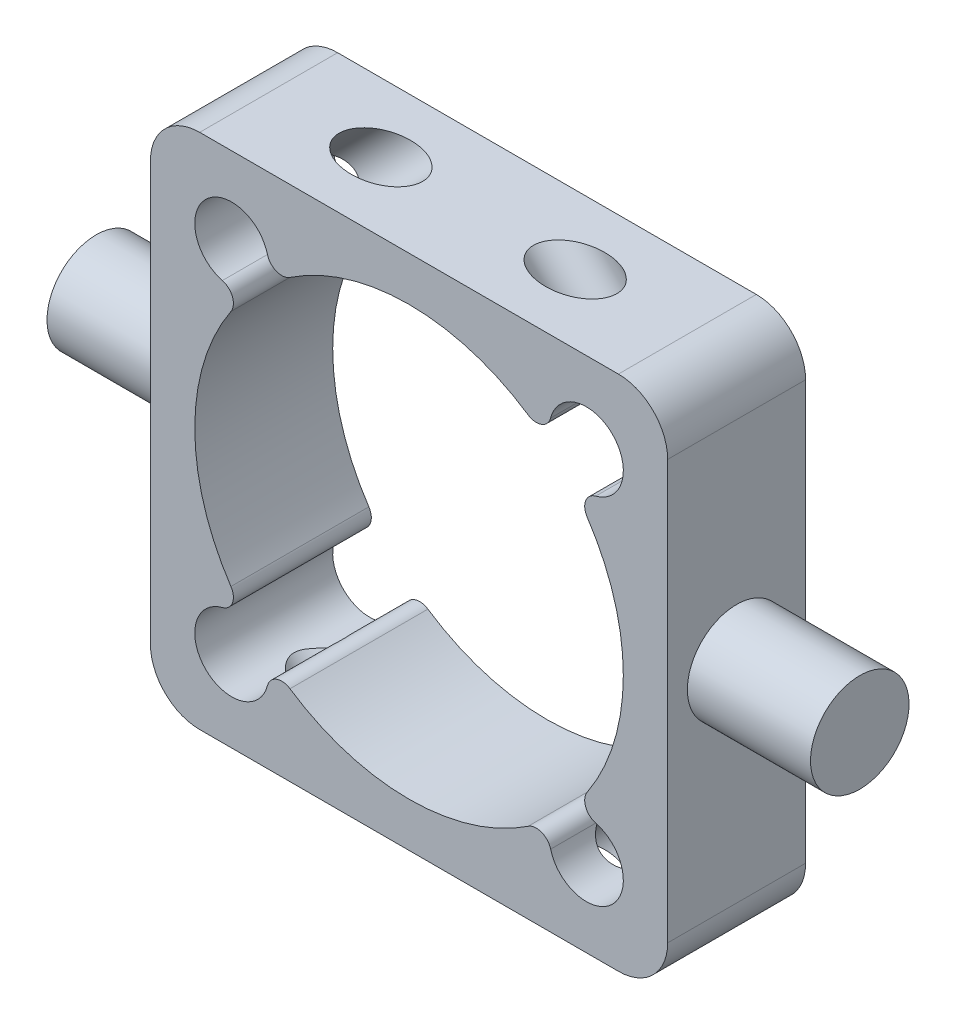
from build123d import *

# Parameters (mm, degrees)
ESBO_O1_W                 = 105
ESBO_O1_H                 = 105
EXTRUS_O1_DEPTH           = 28
ESBO_O2_R                 = 10
EXTRUS_O2_DEPTH           = 25
FILETE2_R                 = 10
ESBO_O6_R                 = 6
EXTRUS_O5_DEPTH           = 37
ESPELHAR3_COPY_1_SKETCH_R = 6
ESPELHAR3_COPY_1_DEPTH    = 37


with BuildPart() as part:
    # Esbo_o1 → Extrus_o1 (new body)
    with BuildSketch(Plane.XY):
        Rectangle(ESBO_O1_W, ESBO_O1_H)
        with BuildLine():
            ThreePointArc((-36.163938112, 24.174771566), (-43.5, 0), (-36.163938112, -24.174771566))
            ThreePointArc((-36.163938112, -24.174771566), (-35.853289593, -26.906696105), (-37.898573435, -28.744283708))
            ThreePointArc((-37.898573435, -28.744283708), (-41.303300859, -41.303300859), (-28.744283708, -37.898573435))
            ThreePointArc((-28.744283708, -37.898573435), (-26.906696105, -35.853289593), (-24.174771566, -36.163938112))
            ThreePointArc((-24.174771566, -36.163938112), (0, -43.5), (24.174771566, -36.163938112))
            ThreePointArc((24.174771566, -36.163938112), (26.906696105, -35.853289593), (28.744283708, -37.898573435))
            ThreePointArc((28.744283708, -37.898573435), (41.303300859, -41.303300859), (37.898573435, -28.744283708))
            ThreePointArc((37.898573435, -28.744283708), (35.853289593, -26.906696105), (36.163938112, -24.174771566))
            ThreePointArc((36.163938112, -24.174771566), (43.5, 0), (36.163938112, 24.174771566))
            ThreePointArc((36.163938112, 24.174771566), (35.853289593, 26.906696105), (37.898573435, 28.744283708))
            ThreePointArc((37.898573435, 28.744283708), (41.303300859, 41.303300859), (28.744283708, 37.898573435))
            ThreePointArc((28.744283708, 37.898573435), (26.906696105, 35.853289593), (24.174771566, 36.163938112))
            ThreePointArc((24.174771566, 36.163938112), (0, 43.5), (-24.174771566, 36.163938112))
            ThreePointArc((-24.174771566, 36.163938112), (-26.906696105, 35.853289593), (-28.744283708, 37.898573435))
            ThreePointArc((-28.744283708, 37.898573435), (-41.303300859, 41.303300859), (-37.898573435, 28.744283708))
            ThreePointArc((-37.898573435, 28.744283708), (-35.853289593, 26.906696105), (-36.163938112, 24.174771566))
        make_face(mode=Mode.SUBTRACT)
    extrude(amount=EXTRUS_O1_DEPTH)

    # Esbo_o2 → Extrus_o2 (add)
    with BuildSketch(Plane.ZY.offset(52.5)):
        with Locations(Location((14, 0, 0), (0, 0, 90))):
            Circle(ESBO_O2_R)
    extrus_o2 = extrude(amount=EXTRUS_O2_DEPTH)

    # Espelhar1: Extrus_o2 across plane
    add(extrus_o2.mirror(Plane(origin=(0, 0, 0), x_dir=(0, 0, 1), z_dir=(1, 0, 0))))

    # Filete2
    filete2_edges = [part.edges().sort_by_distance(p)[0] for p in [
        (-52.5, 52.5, 14),
        (52.5, 52.5, 14),
        (52.5, -52.5, 14),
        (-52.5, -52.5, 14),
    ]]
    fillet(filete2_edges, radius=FILETE2_R)

    # Esbo_o6 → Extrus_o5 (cut)
    with BuildSketch(Plane(origin=(-27.24266029, 27.24266029, 0), x_dir=(0.7071067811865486, 0.7071067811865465, 0), z_dir=(0.7071067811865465, -0.7071067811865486, 0))):
        with Locations(Location((51.071067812, 14, 0), (0, 0, 180))):
            Circle(ESBO_O6_R)
    extrus_o5 = extrude(amount=EXTRUS_O5_DEPTH, mode=Mode.SUBTRACT)

    # Espelhar2: Extrus_o5 across plane
    add(extrus_o5.mirror(Plane(origin=(0, 0, 0), x_dir=(0, 0, 1), z_dir=(1, 0, 0))), mode=Mode.SUBTRACT)

    # Espelhar3: Extrus_o5 across plane
    add(extrus_o5.mirror(Plane.ZX), mode=Mode.SUBTRACT)

    # Espelhar3 copy 1 sketch → Espelhar3 copy 1 (cut)
    with BuildSketch(Plane(origin=(27.24266029, -27.24266029, 0), x_dir=(-0.707106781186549, -0.707106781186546, 0), z_dir=(-0.707106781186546, 0.707106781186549, 0))):
        with Locations(Location((51.071067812, 14, 0), (0, 0, 180))):
            Circle(ESPELHAR3_COPY_1_SKETCH_R)
    extrude(amount=ESPELHAR3_COPY_1_DEPTH, mode=Mode.SUBTRACT)


solid = part.part
